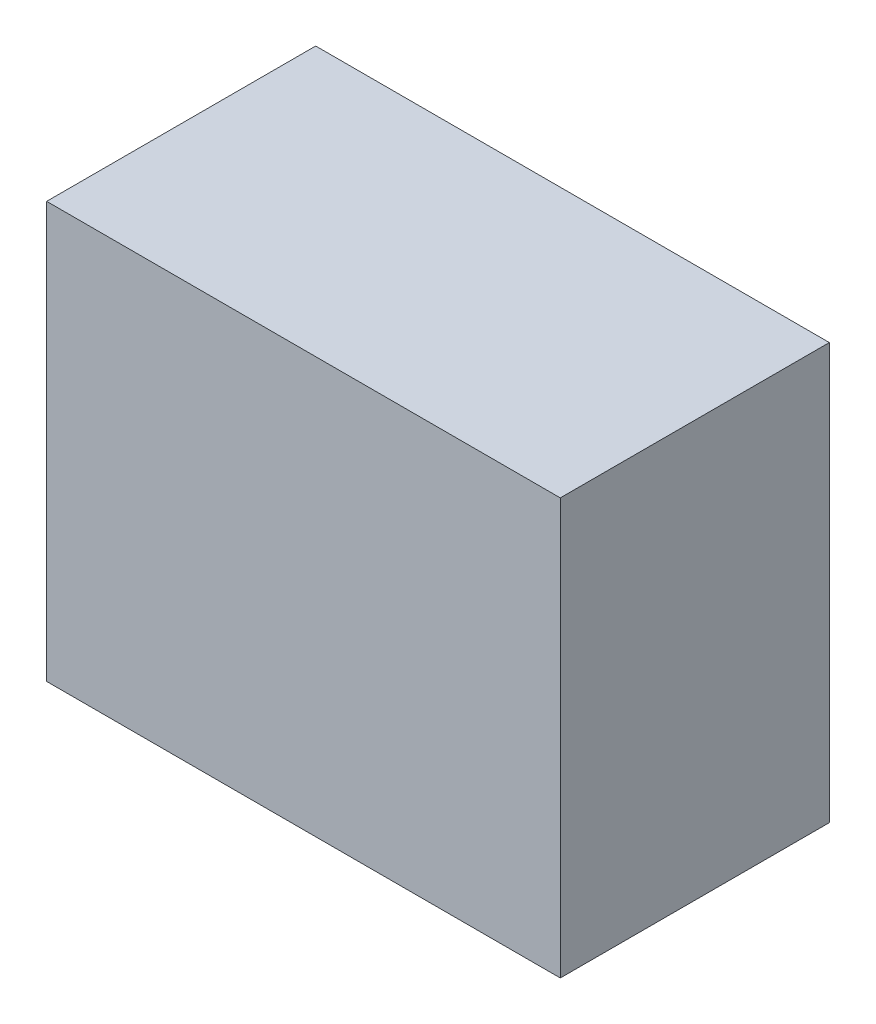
ISO-10303-21;
HEADER;
FILE_DESCRIPTION(('STEP AP214'),'2;1');
FILE_NAME('part.step','',(''),(''),'','','');
FILE_SCHEMA(('AUTOMOTIVE_DESIGN { 1 0 10303 214 1 1 1 1 }'));
ENDSEC;
DATA;
#1=APPLICATION_CONTEXT('core data for automotive mechanical design processes');
#2=APPLICATION_PROTOCOL_DEFINITION('international standard','automotive_design',2000,#1);
#3=PRODUCT_CONTEXT('',#1,'mechanical');
#4=PRODUCT('Part','Part','',(#3));
#5=PRODUCT_RELATED_PRODUCT_CATEGORY('part','',(#4));
#6=PRODUCT_DEFINITION_FORMATION('','',#4);
#7=PRODUCT_DEFINITION_CONTEXT('part definition',#1,'design');
#8=PRODUCT_DEFINITION('design','',#6,#7);
#9=PRODUCT_DEFINITION_SHAPE('','',#8);
#10=(LENGTH_UNIT() NAMED_UNIT(*) SI_UNIT(.MILLI.,.METRE.));
#11=(NAMED_UNIT(*) PLANE_ANGLE_UNIT() SI_UNIT($,.RADIAN.));
#12=(NAMED_UNIT(*) SI_UNIT($,.STERADIAN.) SOLID_ANGLE_UNIT());
#13=UNCERTAINTY_MEASURE_WITH_UNIT(LENGTH_MEASURE(1.E-05),#10,'distance_accuracy_value','');
#14=(GEOMETRIC_REPRESENTATION_CONTEXT(3) GLOBAL_UNCERTAINTY_ASSIGNED_CONTEXT((#13)) GLOBAL_UNIT_ASSIGNED_CONTEXT((#10,
#11,#12)) REPRESENTATION_CONTEXT('',''));
#15=CARTESIAN_POINT('',(0.,0.,0.));
#16=DIRECTION('',(0.,0.,1.));
#17=DIRECTION('',(1.,0.,0.));
#18=AXIS2_PLACEMENT_3D('',#15,#16,#17);
#19=CARTESIAN_POINT('',(0.,1.269999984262E-06,1.10000034));
#20=DIRECTION('',(0.,0.,-1.));
#21=DIRECTION('',(0.,-1.,0.));
#22=AXIS2_PLACEMENT_3D('',#19,#20,#21);
#23=PLANE('',#22);
#24=DIRECTION('',(0.,-1.,0.));
#25=VECTOR('',#24,1.);
#26=CARTESIAN_POINT('',(1.05000044,0.85000084,1.10000034));
#27=LINE('',#26,#25);
#28=CARTESIAN_POINT('',(1.05000044,0.85000084,1.10000034));
#29=VERTEX_POINT('',#28);
#30=CARTESIAN_POINT('',(1.05000044,-0.8499983,1.10000034));
#31=VERTEX_POINT('',#30);
#32=EDGE_CURVE('E25',#29,#31,#27,.T.);
#33=ORIENTED_EDGE('',*,*,#32,.F.);
#34=DIRECTION('',(1.,0.,0.));
#35=VECTOR('',#34,1.);
#36=CARTESIAN_POINT('',(-1.05000044,0.85000084,1.10000034));
#37=LINE('',#36,#35);
#38=CARTESIAN_POINT('',(-1.05000044,0.85000084,1.10000034));
#39=VERTEX_POINT('',#38);
#40=EDGE_CURVE('E108',#39,#29,#37,.T.);
#41=ORIENTED_EDGE('',*,*,#40,.F.);
#42=DIRECTION('',(0.,1.,0.));
#43=VECTOR('',#42,1.);
#44=CARTESIAN_POINT('',(-1.05000044,-0.8499983,1.10000034));
#45=LINE('',#44,#43);
#46=CARTESIAN_POINT('',(-1.05000044,-0.8499983,1.10000034));
#47=VERTEX_POINT('',#46);
#48=EDGE_CURVE('E83',#47,#39,#45,.T.);
#49=ORIENTED_EDGE('',*,*,#48,.F.);
#50=DIRECTION('',(-1.,0.,0.));
#51=VECTOR('',#50,1.);
#52=CARTESIAN_POINT('',(1.05000044,-0.8499983,1.10000034));
#53=LINE('',#52,#51);
#54=EDGE_CURVE('E87',#31,#47,#53,.T.);
#55=ORIENTED_EDGE('',*,*,#54,.F.);
#56=EDGE_LOOP('',(#33,#41,#49,#55));
#57=FACE_BOUND('',#56,.T.);
#58=ADVANCED_FACE('F17',(#57),#23,.F.);
#59=CARTESIAN_POINT('',(0.,1.269999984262E-06,0.));
#60=DIRECTION('',(0.,0.,-1.));
#61=DIRECTION('',(0.,-1.,0.));
#62=AXIS2_PLACEMENT_3D('',#59,#60,#61);
#63=PLANE('',#62);
#64=DIRECTION('',(-1.,0.,0.));
#65=VECTOR('',#64,1.);
#66=CARTESIAN_POINT('',(1.05000044,-0.8499983,0.));
#67=LINE('',#66,#65);
#68=CARTESIAN_POINT('',(1.05000044,-0.8499983,0.));
#69=VERTEX_POINT('',#68);
#70=CARTESIAN_POINT('',(-1.05000044,-0.8499983,0.));
#71=VERTEX_POINT('',#70);
#72=EDGE_CURVE('E71',#69,#71,#67,.T.);
#73=ORIENTED_EDGE('',*,*,#72,.T.);
#74=DIRECTION('',(0.,1.,0.));
#75=VECTOR('',#74,1.);
#76=CARTESIAN_POINT('',(-1.05000044,-0.8499983,0.));
#77=LINE('',#76,#75);
#78=CARTESIAN_POINT('',(-1.05000044,0.85000084,0.));
#79=VERTEX_POINT('',#78);
#80=EDGE_CURVE('E99',#71,#79,#77,.T.);
#81=ORIENTED_EDGE('',*,*,#80,.T.);
#82=DIRECTION('',(1.,0.,0.));
#83=VECTOR('',#82,1.);
#84=CARTESIAN_POINT('',(-1.05000044,0.85000084,0.));
#85=LINE('',#84,#83);
#86=CARTESIAN_POINT('',(1.05000044,0.85000084,0.));
#87=VERTEX_POINT('',#86);
#88=EDGE_CURVE('E73',#79,#87,#85,.T.);
#89=ORIENTED_EDGE('',*,*,#88,.T.);
#90=DIRECTION('',(0.,-1.,0.));
#91=VECTOR('',#90,1.);
#92=CARTESIAN_POINT('',(1.05000044,0.85000084,0.));
#93=LINE('',#92,#91);
#94=EDGE_CURVE('E11',#87,#69,#93,.T.);
#95=ORIENTED_EDGE('',*,*,#94,.T.);
#96=EDGE_LOOP('',(#73,#81,#89,#95));
#97=FACE_BOUND('',#96,.T.);
#98=ADVANCED_FACE('F69',(#97),#63,.T.);
#99=CARTESIAN_POINT('',(1.05000044,0.85000084,0.));
#100=DIRECTION('',(1.,0.,0.));
#101=DIRECTION('',(0.,1.,0.));
#102=AXIS2_PLACEMENT_3D('',#99,#100,#101);
#103=PLANE('',#102);
#104=DIRECTION('',(0.,0.,1.));
#105=VECTOR('',#104,1.);
#106=CARTESIAN_POINT('',(1.05000044,0.85000084,0.));
#107=LINE('',#106,#105);
#108=EDGE_CURVE('E112',#87,#29,#107,.T.);
#109=ORIENTED_EDGE('',*,*,#108,.T.);
#110=ORIENTED_EDGE('',*,*,#32,.T.);
#111=DIRECTION('',(0.,0.,1.));
#112=VECTOR('',#111,1.);
#113=CARTESIAN_POINT('',(1.05000044,-0.8499983,0.));
#114=LINE('',#113,#112);
#115=EDGE_CURVE('E79',#69,#31,#114,.T.);
#116=ORIENTED_EDGE('',*,*,#115,.F.);
#117=ORIENTED_EDGE('',*,*,#94,.F.);
#118=EDGE_LOOP('',(#109,#110,#116,#117));
#119=FACE_BOUND('',#118,.T.);
#120=ADVANCED_FACE('F85',(#119),#103,.T.);
#121=CARTESIAN_POINT('',(-1.05000044,0.85000084,0.));
#122=DIRECTION('',(0.,1.,0.));
#123=DIRECTION('',(1.,0.,0.));
#124=AXIS2_PLACEMENT_3D('',#121,#122,#123);
#125=PLANE('',#124);
#126=DIRECTION('',(0.,0.,1.));
#127=VECTOR('',#126,1.);
#128=CARTESIAN_POINT('',(-1.05000044,0.85000084,0.));
#129=LINE('',#128,#127);
#130=EDGE_CURVE('E96',#79,#39,#129,.T.);
#131=ORIENTED_EDGE('',*,*,#130,.T.);
#132=ORIENTED_EDGE('',*,*,#40,.T.);
#133=ORIENTED_EDGE('',*,*,#108,.F.);
#134=ORIENTED_EDGE('',*,*,#88,.F.);
#135=EDGE_LOOP('',(#131,#132,#133,#134));
#136=FACE_BOUND('',#135,.T.);
#137=ADVANCED_FACE('F155',(#136),#125,.T.);
#138=CARTESIAN_POINT('',(-1.05000044,-0.8499983,0.));
#139=DIRECTION('',(-1.,0.,0.));
#140=DIRECTION('',(0.,0.,1.));
#141=AXIS2_PLACEMENT_3D('',#138,#139,#140);
#142=PLANE('',#141);
#143=DIRECTION('',(0.,0.,1.));
#144=VECTOR('',#143,1.);
#145=CARTESIAN_POINT('',(-1.05000044,-0.8499983,0.));
#146=LINE('',#145,#144);
#147=EDGE_CURVE('E81',#71,#47,#146,.T.);
#148=ORIENTED_EDGE('',*,*,#147,.T.);
#149=ORIENTED_EDGE('',*,*,#48,.T.);
#150=ORIENTED_EDGE('',*,*,#130,.F.);
#151=ORIENTED_EDGE('',*,*,#80,.F.);
#152=EDGE_LOOP('',(#148,#149,#150,#151));
#153=FACE_BOUND('',#152,.T.);
#154=ADVANCED_FACE('F152',(#153),#142,.T.);
#155=CARTESIAN_POINT('',(1.05000044,-0.8499983,0.));
#156=DIRECTION('',(0.,-1.,0.));
#157=DIRECTION('',(0.,0.,-1.));
#158=AXIS2_PLACEMENT_3D('',#155,#156,#157);
#159=PLANE('',#158);
#160=ORIENTED_EDGE('',*,*,#115,.T.);
#161=ORIENTED_EDGE('',*,*,#54,.T.);
#162=ORIENTED_EDGE('',*,*,#147,.F.);
#163=ORIENTED_EDGE('',*,*,#72,.F.);
#164=EDGE_LOOP('',(#160,#161,#162,#163));
#165=FACE_BOUND('',#164,.T.);
#166=ADVANCED_FACE('F77',(#165),#159,.T.);
#167=CLOSED_SHELL('',(#58,#98,#120,#137,#154,#166));
#168=MANIFOLD_SOLID_BREP('B1',#167);
#169=ADVANCED_BREP_SHAPE_REPRESENTATION('',(#18,#168),#14);
#170=SHAPE_DEFINITION_REPRESENTATION(#9,#169);
ENDSEC;
END-ISO-10303-21;
